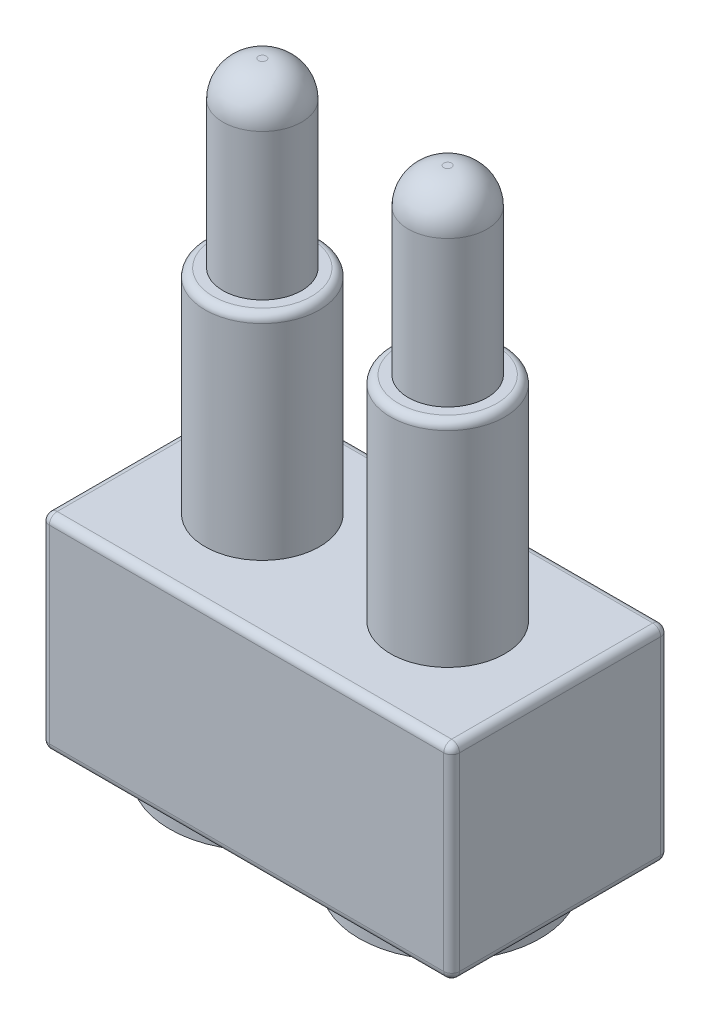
ISO-10303-21;
HEADER;
FILE_DESCRIPTION(('STEP AP214'),'2;1');
FILE_NAME('part.step','',(''),(''),'','','');
FILE_SCHEMA(('AUTOMOTIVE_DESIGN { 1 0 10303 214 1 1 1 1 }'));
ENDSEC;
DATA;
#1=APPLICATION_CONTEXT('core data for automotive mechanical design processes');
#2=APPLICATION_PROTOCOL_DEFINITION('international standard','automotive_design',2000,#1);
#3=PRODUCT_CONTEXT('',#1,'mechanical');
#4=PRODUCT('Part','Part','',(#3));
#5=PRODUCT_RELATED_PRODUCT_CATEGORY('part','',(#4));
#6=PRODUCT_DEFINITION_FORMATION('','',#4);
#7=PRODUCT_DEFINITION_CONTEXT('part definition',#1,'design');
#8=PRODUCT_DEFINITION('design','',#6,#7);
#9=PRODUCT_DEFINITION_SHAPE('','',#8);
#10=(LENGTH_UNIT() NAMED_UNIT(*) SI_UNIT(.MILLI.,.METRE.));
#11=(NAMED_UNIT(*) PLANE_ANGLE_UNIT() SI_UNIT($,.RADIAN.));
#12=(NAMED_UNIT(*) SI_UNIT($,.STERADIAN.) SOLID_ANGLE_UNIT());
#13=UNCERTAINTY_MEASURE_WITH_UNIT(LENGTH_MEASURE(1.E-05),#10,'distance_accuracy_value','');
#14=(GEOMETRIC_REPRESENTATION_CONTEXT(3) GLOBAL_UNCERTAINTY_ASSIGNED_CONTEXT((#13)) GLOBAL_UNIT_ASSIGNED_CONTEXT((#10,
#11,#12)) REPRESENTATION_CONTEXT('',''));
#15=CARTESIAN_POINT('',(0.,0.,0.));
#16=DIRECTION('',(0.,0.,1.));
#17=DIRECTION('',(1.,0.,0.));
#18=AXIS2_PLACEMENT_3D('',#15,#16,#17);
#19=CARTESIAN_POINT('',(2.6,2.6,-1.375));
#20=DIRECTION('',(-1.,0.,0.));
#21=DIRECTION('',(0.,0.,1.));
#22=AXIS2_PLACEMENT_3D('',#19,#20,#21);
#23=PLANE('',#22);
#24=DIRECTION('',(0.,0.,-1.));
#25=VECTOR('',#24,1.);
#26=CARTESIAN_POINT('',(2.6,2.5,1.375));
#27=LINE('',#26,#25);
#28=CARTESIAN_POINT('',(2.6,2.5,-1.275));
#29=VERTEX_POINT('',#28);
#30=CARTESIAN_POINT('',(2.6,2.5,1.275));
#31=VERTEX_POINT('',#30);
#32=EDGE_CURVE('E145',#29,#31,#27,.F.);
#33=ORIENTED_EDGE('',*,*,#32,.T.);
#34=DIRECTION('',(0.,-1.,0.));
#35=VECTOR('',#34,1.);
#36=CARTESIAN_POINT('',(2.6,2.6,1.275));
#37=LINE('',#36,#35);
#38=CARTESIAN_POINT('',(2.6,0.0999999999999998,1.275));
#39=VERTEX_POINT('',#38);
#40=EDGE_CURVE('E195',#31,#39,#37,.T.);
#41=ORIENTED_EDGE('',*,*,#40,.T.);
#42=DIRECTION('',(0.,0.,-1.));
#43=VECTOR('',#42,1.);
#44=CARTESIAN_POINT('',(2.6,0.0999999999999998,-1.375));
#45=LINE('',#44,#43);
#46=CARTESIAN_POINT('',(2.6,0.0999999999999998,-1.275));
#47=VERTEX_POINT('',#46);
#48=EDGE_CURVE('E192',#39,#47,#45,.T.);
#49=ORIENTED_EDGE('',*,*,#48,.T.);
#50=DIRECTION('',(0.,-1.,0.));
#51=VECTOR('',#50,1.);
#52=CARTESIAN_POINT('',(2.6,2.6,-1.275));
#53=LINE('',#52,#51);
#54=EDGE_CURVE('E190',#47,#29,#53,.F.);
#55=ORIENTED_EDGE('',*,*,#54,.T.);
#56=EDGE_LOOP('',(#33,#41,#49,#55));
#57=FACE_BOUND('',#56,.T.);
#58=ADVANCED_FACE('F37',(#57),#23,.F.);
#59=CARTESIAN_POINT('',(-2.6,2.6,-1.375));
#60=DIRECTION('',(0.,0.,1.));
#61=DIRECTION('',(1.,0.,0.));
#62=AXIS2_PLACEMENT_3D('',#59,#60,#61);
#63=PLANE('',#62);
#64=DIRECTION('',(-1.,0.,0.));
#65=VECTOR('',#64,1.);
#66=CARTESIAN_POINT('',(2.6,2.5,-1.375));
#67=LINE('',#66,#65);
#68=CARTESIAN_POINT('',(-2.5,2.5,-1.375));
#69=VERTEX_POINT('',#68);
#70=CARTESIAN_POINT('',(2.5,2.5,-1.375));
#71=VERTEX_POINT('',#70);
#72=EDGE_CURVE('E46',#69,#71,#67,.F.);
#73=ORIENTED_EDGE('',*,*,#72,.T.);
#74=DIRECTION('',(0.,-1.,0.));
#75=VECTOR('',#74,1.);
#76=CARTESIAN_POINT('',(2.5,2.6,-1.375));
#77=LINE('',#76,#75);
#78=CARTESIAN_POINT('',(2.5,0.0999999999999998,-1.375));
#79=VERTEX_POINT('',#78);
#80=EDGE_CURVE('E11',#71,#79,#77,.T.);
#81=ORIENTED_EDGE('',*,*,#80,.T.);
#82=DIRECTION('',(-1.,0.,0.));
#83=VECTOR('',#82,1.);
#84=CARTESIAN_POINT('',(-2.6,0.0999999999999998,-1.375));
#85=LINE('',#84,#83);
#86=CARTESIAN_POINT('',(-2.5,0.0999999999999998,-1.375));
#87=VERTEX_POINT('',#86);
#88=EDGE_CURVE('E206',#79,#87,#85,.T.);
#89=ORIENTED_EDGE('',*,*,#88,.T.);
#90=DIRECTION('',(0.,-1.,0.));
#91=VECTOR('',#90,1.);
#92=CARTESIAN_POINT('',(-2.5,2.6,-1.375));
#93=LINE('',#92,#91);
#94=EDGE_CURVE('E57',#87,#69,#93,.F.);
#95=ORIENTED_EDGE('',*,*,#94,.T.);
#96=EDGE_LOOP('',(#73,#81,#89,#95));
#97=FACE_BOUND('',#96,.T.);
#98=ADVANCED_FACE('F332',(#97),#63,.F.);
#99=CARTESIAN_POINT('',(-2.6,2.6,-1.375));
#100=DIRECTION('',(1.,0.,0.));
#101=DIRECTION('',(0.,0.,-1.));
#102=AXIS2_PLACEMENT_3D('',#99,#100,#101);
#103=PLANE('',#102);
#104=DIRECTION('',(0.,0.,1.));
#105=VECTOR('',#104,1.);
#106=CARTESIAN_POINT('',(-2.6,0.0999999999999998,-1.375));
#107=LINE('',#106,#105);
#108=CARTESIAN_POINT('',(-2.6,0.0999999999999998,-1.275));
#109=VERTEX_POINT('',#108);
#110=CARTESIAN_POINT('',(-2.6,0.0999999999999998,1.275));
#111=VERTEX_POINT('',#110);
#112=EDGE_CURVE('E174',#109,#111,#107,.T.);
#113=ORIENTED_EDGE('',*,*,#112,.T.);
#114=DIRECTION('',(0.,-1.,0.));
#115=VECTOR('',#114,1.);
#116=CARTESIAN_POINT('',(-2.6,2.6,1.275));
#117=LINE('',#116,#115);
#118=CARTESIAN_POINT('',(-2.6,2.5,1.275));
#119=VERTEX_POINT('',#118);
#120=EDGE_CURVE('E179',#111,#119,#117,.F.);
#121=ORIENTED_EDGE('',*,*,#120,.T.);
#122=DIRECTION('',(0.,0.,1.));
#123=VECTOR('',#122,1.);
#124=CARTESIAN_POINT('',(-2.6,2.5,-1.375));
#125=LINE('',#124,#123);
#126=CARTESIAN_POINT('',(-2.6,2.5,-1.275));
#127=VERTEX_POINT('',#126);
#128=EDGE_CURVE('E176',#119,#127,#125,.F.);
#129=ORIENTED_EDGE('',*,*,#128,.T.);
#130=DIRECTION('',(0.,-1.,0.));
#131=VECTOR('',#130,1.);
#132=CARTESIAN_POINT('',(-2.6,2.6,-1.275));
#133=LINE('',#132,#131);
#134=EDGE_CURVE('E172',#127,#109,#133,.T.);
#135=ORIENTED_EDGE('',*,*,#134,.T.);
#136=EDGE_LOOP('',(#113,#121,#129,#135));
#137=FACE_BOUND('',#136,.T.);
#138=ADVANCED_FACE('F338',(#137),#103,.F.);
#139=CARTESIAN_POINT('',(-2.6,2.6,1.375));
#140=DIRECTION('',(0.,0.,-1.));
#141=DIRECTION('',(-1.,0.,0.));
#142=AXIS2_PLACEMENT_3D('',#139,#140,#141);
#143=PLANE('',#142);
#144=DIRECTION('',(1.,0.,0.));
#145=VECTOR('',#144,1.);
#146=CARTESIAN_POINT('',(-2.6,2.5,1.375));
#147=LINE('',#146,#145);
#148=CARTESIAN_POINT('',(2.5,2.5,1.375));
#149=VERTEX_POINT('',#148);
#150=CARTESIAN_POINT('',(-2.5,2.5,1.375));
#151=VERTEX_POINT('',#150);
#152=EDGE_CURVE('E201',#149,#151,#147,.F.);
#153=ORIENTED_EDGE('',*,*,#152,.T.);
#154=DIRECTION('',(0.,-1.,0.));
#155=VECTOR('',#154,1.);
#156=CARTESIAN_POINT('',(-2.5,2.6,1.375));
#157=LINE('',#156,#155);
#158=CARTESIAN_POINT('',(-2.5,0.0999999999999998,1.375));
#159=VERTEX_POINT('',#158);
#160=EDGE_CURVE('E203',#151,#159,#157,.T.);
#161=ORIENTED_EDGE('',*,*,#160,.T.);
#162=DIRECTION('',(1.,0.,0.));
#163=VECTOR('',#162,1.);
#164=CARTESIAN_POINT('',(-2.6,0.0999999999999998,1.375));
#165=LINE('',#164,#163);
#166=CARTESIAN_POINT('',(2.5,0.0999999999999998,1.375));
#167=VERTEX_POINT('',#166);
#168=EDGE_CURVE('E197',#159,#167,#165,.T.);
#169=ORIENTED_EDGE('',*,*,#168,.T.);
#170=DIRECTION('',(0.,-1.,0.));
#171=VECTOR('',#170,1.);
#172=CARTESIAN_POINT('',(2.5,2.6,1.375));
#173=LINE('',#172,#171);
#174=EDGE_CURVE('E199',#167,#149,#173,.F.);
#175=ORIENTED_EDGE('',*,*,#174,.T.);
#176=EDGE_LOOP('',(#153,#161,#169,#175));
#177=FACE_BOUND('',#176,.T.);
#178=ADVANCED_FACE('F405',(#177),#143,.F.);
#179=CARTESIAN_POINT('',(0.,2.6,0.));
#180=DIRECTION('',(0.,1.,0.));
#181=DIRECTION('',(0.,0.,1.));
#182=AXIS2_PLACEMENT_3D('',#179,#180,#181);
#183=PLANE('',#182);
#184=DIRECTION('',(0.,0.,1.));
#185=VECTOR('',#184,1.);
#186=CARTESIAN_POINT('',(-2.5,2.6,1.375));
#187=LINE('',#186,#185);
#188=CARTESIAN_POINT('',(-2.5,2.6,-1.275));
#189=VERTEX_POINT('',#188);
#190=CARTESIAN_POINT('',(-2.5,2.6,1.275));
#191=VERTEX_POINT('',#190);
#192=EDGE_CURVE('E137',#189,#191,#187,.T.);
#193=ORIENTED_EDGE('',*,*,#192,.T.);
#194=DIRECTION('',(1.,0.,0.));
#195=VECTOR('',#194,1.);
#196=CARTESIAN_POINT('',(2.6,2.6,1.275));
#197=LINE('',#196,#195);
#198=CARTESIAN_POINT('',(2.5,2.6,1.275));
#199=VERTEX_POINT('',#198);
#200=EDGE_CURVE('E133',#191,#199,#197,.T.);
#201=ORIENTED_EDGE('',*,*,#200,.T.);
#202=DIRECTION('',(0.,0.,-1.));
#203=VECTOR('',#202,1.);
#204=CARTESIAN_POINT('',(2.5,2.6,-1.375));
#205=LINE('',#204,#203);
#206=CARTESIAN_POINT('',(2.5,2.6,-1.275));
#207=VERTEX_POINT('',#206);
#208=EDGE_CURVE('E124',#199,#207,#205,.T.);
#209=ORIENTED_EDGE('',*,*,#208,.T.);
#210=DIRECTION('',(-1.,0.,0.));
#211=VECTOR('',#210,1.);
#212=CARTESIAN_POINT('',(-2.6,2.6,-1.275));
#213=LINE('',#212,#211);
#214=EDGE_CURVE('E130',#207,#189,#213,.T.);
#215=ORIENTED_EDGE('',*,*,#214,.T.);
#216=EDGE_LOOP('',(#193,#201,#209,#215));
#217=FACE_BOUND('',#216,.T.);
#218=CARTESIAN_POINT('',(1.175,2.6,0.));
#219=DIRECTION('',(0.,1.,0.));
#220=DIRECTION('',(0.,0.,-1.));
#221=AXIS2_PLACEMENT_3D('',#218,#219,#220);
#222=CIRCLE('',#221,0.725);
#223=CARTESIAN_POINT('',(1.175,2.6,-0.725000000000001));
#224=VERTEX_POINT('',#223);
#225=EDGE_CURVE('E263',#224,#224,#222,.T.);
#226=ORIENTED_EDGE('',*,*,#225,.F.);
#227=EDGE_LOOP('',(#226));
#228=FACE_BOUND('',#227,.T.);
#229=CARTESIAN_POINT('',(-1.175,2.6,0.));
#230=DIRECTION('',(0.,1.,0.));
#231=DIRECTION('',(0.,0.,1.));
#232=AXIS2_PLACEMENT_3D('',#229,#230,#231);
#233=CIRCLE('',#232,0.725);
#234=CARTESIAN_POINT('',(-1.175,2.6,-0.725));
#235=VERTEX_POINT('',#234);
#236=EDGE_CURVE('E269',#235,#235,#233,.T.);
#237=ORIENTED_EDGE('',*,*,#236,.F.);
#238=EDGE_LOOP('',(#237));
#239=FACE_BOUND('',#238,.T.);
#240=ADVANCED_FACE('F127',(#217,#228,#239),#183,.T.);
#241=CARTESIAN_POINT('',(0.,0.,0.));
#242=DIRECTION('',(0.,1.,0.));
#243=DIRECTION('',(0.,0.,1.));
#244=AXIS2_PLACEMENT_3D('',#241,#242,#243);
#245=PLANE('',#244);
#246=DIRECTION('',(0.,0.,-1.));
#247=VECTOR('',#246,1.);
#248=CARTESIAN_POINT('',(2.5,0.,0.));
#249=LINE('',#248,#247);
#250=CARTESIAN_POINT('',(2.5,0.,-1.275));
#251=VERTEX_POINT('',#250);
#252=CARTESIAN_POINT('',(2.5,0.,1.275));
#253=VERTEX_POINT('',#252);
#254=EDGE_CURVE('E183',#251,#253,#249,.F.);
#255=ORIENTED_EDGE('',*,*,#254,.T.);
#256=DIRECTION('',(1.,0.,0.));
#257=VECTOR('',#256,1.);
#258=CARTESIAN_POINT('',(0.,0.,1.275));
#259=LINE('',#258,#257);
#260=CARTESIAN_POINT('',(-2.5,0.,1.275));
#261=VERTEX_POINT('',#260);
#262=EDGE_CURVE('E188',#253,#261,#259,.F.);
#263=ORIENTED_EDGE('',*,*,#262,.T.);
#264=DIRECTION('',(0.,0.,1.));
#265=VECTOR('',#264,1.);
#266=CARTESIAN_POINT('',(-2.5,0.,0.));
#267=LINE('',#266,#265);
#268=CARTESIAN_POINT('',(-2.5,0.,-1.275));
#269=VERTEX_POINT('',#268);
#270=EDGE_CURVE('E185',#261,#269,#267,.F.);
#271=ORIENTED_EDGE('',*,*,#270,.T.);
#272=DIRECTION('',(-1.,0.,0.));
#273=VECTOR('',#272,1.);
#274=CARTESIAN_POINT('',(0.,0.,-1.275));
#275=LINE('',#274,#273);
#276=EDGE_CURVE('E181',#269,#251,#275,.F.);
#277=ORIENTED_EDGE('',*,*,#276,.T.);
#278=EDGE_LOOP('',(#255,#263,#271,#277));
#279=FACE_BOUND('',#278,.T.);
#280=CARTESIAN_POINT('',(1.2,0.,0.));
#281=DIRECTION('',(0.,1.,0.));
#282=DIRECTION('',(0.,0.,1.));
#283=AXIS2_PLACEMENT_3D('',#280,#281,#282);
#284=CIRCLE('',#283,1.15);
#285=CARTESIAN_POINT('',(1.2,0.,1.15));
#286=VERTEX_POINT('',#285);
#287=EDGE_CURVE('E288',#286,#286,#284,.F.);
#288=ORIENTED_EDGE('',*,*,#287,.F.);
#289=EDGE_LOOP('',(#288));
#290=FACE_BOUND('',#289,.T.);
#291=CARTESIAN_POINT('',(-1.2,0.,0.));
#292=DIRECTION('',(0.,1.,0.));
#293=DIRECTION('',(0.,0.,1.));
#294=AXIS2_PLACEMENT_3D('',#291,#292,#293);
#295=CIRCLE('',#294,1.15);
#296=CARTESIAN_POINT('',(-1.2,0.,1.15));
#297=VERTEX_POINT('',#296);
#298=EDGE_CURVE('E285',#297,#297,#295,.F.);
#299=ORIENTED_EDGE('',*,*,#298,.F.);
#300=EDGE_LOOP('',(#299));
#301=FACE_BOUND('',#300,.T.);
#302=ADVANCED_FACE('F401',(#279,#290,#301),#245,.F.);
#303=CARTESIAN_POINT('',(-1.2,-0.3,0.));
#304=DIRECTION('',(0.,1.,0.));
#305=DIRECTION('',(0.,0.,1.));
#306=AXIS2_PLACEMENT_3D('',#303,#304,#305);
#307=CYLINDRICAL_SURFACE('',#306,1.15);
#308=CARTESIAN_POINT('',(-1.2,-0.3,0.));
#309=DIRECTION('',(0.,-1.,0.));
#310=DIRECTION('',(0.,0.,-1.));
#311=AXIS2_PLACEMENT_3D('',#308,#309,#310);
#312=CIRCLE('',#311,1.15);
#313=CARTESIAN_POINT('',(-1.2,-0.3,-1.15));
#314=VERTEX_POINT('',#313);
#315=EDGE_CURVE('E282',#314,#314,#312,.T.);
#316=ORIENTED_EDGE('',*,*,#315,.F.);
#317=EDGE_LOOP('',(#316));
#318=FACE_BOUND('',#317,.T.);
#319=ORIENTED_EDGE('',*,*,#298,.T.);
#320=EDGE_LOOP('',(#319));
#321=FACE_BOUND('',#320,.T.);
#322=ADVANCED_FACE('F397',(#318,#321),#307,.T.);
#323=CARTESIAN_POINT('',(-1.2,-0.3,0.));
#324=DIRECTION('',(0.,-1.,0.));
#325=DIRECTION('',(0.,0.,-1.));
#326=AXIS2_PLACEMENT_3D('',#323,#324,#325);
#327=PLANE('',#326);
#328=ORIENTED_EDGE('',*,*,#315,.T.);
#329=EDGE_LOOP('',(#328));
#330=FACE_BOUND('',#329,.T.);
#331=ADVANCED_FACE('F393',(#330),#327,.T.);
#332=CARTESIAN_POINT('',(1.2,-0.3,0.));
#333=DIRECTION('',(0.,1.,0.));
#334=DIRECTION('',(0.,0.,1.));
#335=AXIS2_PLACEMENT_3D('',#332,#333,#334);
#336=CYLINDRICAL_SURFACE('',#335,1.15);
#337=CARTESIAN_POINT('',(1.2,-0.3,0.));
#338=DIRECTION('',(0.,-1.,0.));
#339=DIRECTION('',(0.,0.,1.));
#340=AXIS2_PLACEMENT_3D('',#337,#338,#339);
#341=CIRCLE('',#340,1.15);
#342=CARTESIAN_POINT('',(1.2,-0.3,1.15));
#343=VERTEX_POINT('',#342);
#344=EDGE_CURVE('E274',#343,#343,#341,.T.);
#345=ORIENTED_EDGE('',*,*,#344,.F.);
#346=EDGE_LOOP('',(#345));
#347=FACE_BOUND('',#346,.T.);
#348=ORIENTED_EDGE('',*,*,#287,.T.);
#349=EDGE_LOOP('',(#348));
#350=FACE_BOUND('',#349,.T.);
#351=ADVANCED_FACE('F389',(#347,#350),#336,.T.);
#352=CARTESIAN_POINT('',(1.2,-0.3,0.));
#353=DIRECTION('',(0.,1.,0.));
#354=DIRECTION('',(0.,0.,1.));
#355=AXIS2_PLACEMENT_3D('',#352,#353,#354);
#356=PLANE('',#355);
#357=ORIENTED_EDGE('',*,*,#344,.T.);
#358=EDGE_LOOP('',(#357));
#359=FACE_BOUND('',#358,.T.);
#360=ADVANCED_FACE('F385',(#359),#356,.F.);
#361=CARTESIAN_POINT('',(-1.175,5.3,0.));
#362=DIRECTION('',(0.,-1.,0.));
#363=DIRECTION('',(0.,0.,-1.));
#364=AXIS2_PLACEMENT_3D('',#361,#362,#363);
#365=CYLINDRICAL_SURFACE('',#364,0.725);
#366=CARTESIAN_POINT('',(-1.175,5.2,0.));
#367=DIRECTION('',(0.,1.,0.));
#368=DIRECTION('',(0.,0.,1.));
#369=AXIS2_PLACEMENT_3D('',#366,#367,#368);
#370=CIRCLE('',#369,0.725);
#371=CARTESIAN_POINT('',(-1.175,5.2,-0.725));
#372=VERTEX_POINT('',#371);
#373=EDGE_CURVE('E307',#372,#372,#370,.F.);
#374=CARTESIAN_POINT('',(-1.175,5.2,-0.725));
#375=CARTESIAN_POINT('',(-1.175,5.17291666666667,-0.725));
#376=CARTESIAN_POINT('',(-1.175,5.14583333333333,-0.725));
#377=CARTESIAN_POINT('',(-1.175,5.09166666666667,-0.725));
#378=CARTESIAN_POINT('',(-1.175,5.06458333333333,-0.725));
#379=CARTESIAN_POINT('',(-1.175,5.01041666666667,-0.725));
#380=CARTESIAN_POINT('',(-1.175,4.98333333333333,-0.725));
#381=CARTESIAN_POINT('',(-1.175,4.92916666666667,-0.725));
#382=CARTESIAN_POINT('',(-1.175,4.90208333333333,-0.725));
#383=CARTESIAN_POINT('',(-1.175,4.84791666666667,-0.725));
#384=CARTESIAN_POINT('',(-1.175,4.82083333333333,-0.725));
#385=CARTESIAN_POINT('',(-1.175,4.76666666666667,-0.725));
#386=CARTESIAN_POINT('',(-1.175,4.73958333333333,-0.725));
#387=CARTESIAN_POINT('',(-1.175,4.68541666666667,-0.725));
#388=CARTESIAN_POINT('',(-1.175,4.65833333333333,-0.725));
#389=CARTESIAN_POINT('',(-1.175,4.60416666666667,-0.725));
#390=CARTESIAN_POINT('',(-1.175,4.57708333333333,-0.725));
#391=CARTESIAN_POINT('',(-1.175,4.52291666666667,-0.725));
#392=CARTESIAN_POINT('',(-1.175,4.49583333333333,-0.725));
#393=CARTESIAN_POINT('',(-1.175,4.44166666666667,-0.725));
#394=CARTESIAN_POINT('',(-1.175,4.41458333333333,-0.725));
#395=CARTESIAN_POINT('',(-1.175,4.36041666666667,-0.725));
#396=CARTESIAN_POINT('',(-1.175,4.33333333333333,-0.725));
#397=CARTESIAN_POINT('',(-1.175,4.27916666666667,-0.725));
#398=CARTESIAN_POINT('',(-1.175,4.25208333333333,-0.725));
#399=CARTESIAN_POINT('',(-1.175,4.19791666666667,-0.725));
#400=CARTESIAN_POINT('',(-1.175,4.17083333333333,-0.725));
#401=CARTESIAN_POINT('',(-1.175,4.11666666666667,-0.725));
#402=CARTESIAN_POINT('',(-1.175,4.08958333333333,-0.725));
#403=CARTESIAN_POINT('',(-1.175,4.03541666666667,-0.725));
#404=CARTESIAN_POINT('',(-1.175,4.00833333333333,-0.725));
#405=CARTESIAN_POINT('',(-1.175,3.95416666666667,-0.725));
#406=CARTESIAN_POINT('',(-1.175,3.92708333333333,-0.725));
#407=CARTESIAN_POINT('',(-1.175,3.87291666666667,-0.725));
#408=CARTESIAN_POINT('',(-1.175,3.84583333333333,-0.725));
#409=CARTESIAN_POINT('',(-1.175,3.79166666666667,-0.725));
#410=CARTESIAN_POINT('',(-1.175,3.76458333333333,-0.725));
#411=CARTESIAN_POINT('',(-1.175,3.71041666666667,-0.725));
#412=CARTESIAN_POINT('',(-1.175,3.68333333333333,-0.725));
#413=CARTESIAN_POINT('',(-1.175,3.62916666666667,-0.725));
#414=CARTESIAN_POINT('',(-1.175,3.60208333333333,-0.725));
#415=CARTESIAN_POINT('',(-1.175,3.54791666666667,-0.725));
#416=CARTESIAN_POINT('',(-1.175,3.52083333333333,-0.725));
#417=CARTESIAN_POINT('',(-1.175,3.46666666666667,-0.725));
#418=CARTESIAN_POINT('',(-1.175,3.43958333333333,-0.725));
#419=CARTESIAN_POINT('',(-1.175,3.38541666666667,-0.725));
#420=CARTESIAN_POINT('',(-1.175,3.35833333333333,-0.725));
#421=CARTESIAN_POINT('',(-1.175,3.30416666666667,-0.725));
#422=CARTESIAN_POINT('',(-1.175,3.27708333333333,-0.725));
#423=CARTESIAN_POINT('',(-1.175,3.22291666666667,-0.725));
#424=CARTESIAN_POINT('',(-1.175,3.19583333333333,-0.725));
#425=CARTESIAN_POINT('',(-1.175,3.14166666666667,-0.725));
#426=CARTESIAN_POINT('',(-1.175,3.11458333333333,-0.725));
#427=CARTESIAN_POINT('',(-1.175,3.06041666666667,-0.725));
#428=CARTESIAN_POINT('',(-1.175,3.03333333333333,-0.725));
#429=CARTESIAN_POINT('',(-1.175,2.97916666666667,-0.725));
#430=CARTESIAN_POINT('',(-1.175,2.95208333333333,-0.725));
#431=CARTESIAN_POINT('',(-1.175,2.89791666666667,-0.725));
#432=CARTESIAN_POINT('',(-1.175,2.87083333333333,-0.725));
#433=CARTESIAN_POINT('',(-1.175,2.81666666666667,-0.725));
#434=CARTESIAN_POINT('',(-1.175,2.78958333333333,-0.725));
#435=CARTESIAN_POINT('',(-1.175,2.73541666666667,-0.725));
#436=CARTESIAN_POINT('',(-1.175,2.70833333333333,-0.725));
#437=CARTESIAN_POINT('',(-1.175,2.65416666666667,-0.725));
#438=CARTESIAN_POINT('',(-1.175,2.62708333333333,-0.725));
#439=CARTESIAN_POINT('',(-1.175,2.6,-0.725));
#440=B_SPLINE_CURVE_WITH_KNOTS('',3,(#374,#375,#376,#377,#378,#379,#380,#381,#382,#383,#384,
#385,#386,#387,#388,#389,#390,#391,#392,#393,#394,#395,#396,#397,#398,#399,#400,#401,#402,#403,
#404,#405,#406,#407,#408,#409,#410,#411,#412,#413,#414,#415,#416,#417,#418,#419,#420,#421,#422,
#423,#424,#425,#426,#427,#428,#429,#430,#431,#432,#433,#434,#435,#436,#437,#438,#439),
.UNSPECIFIED.,.F.,.F.,(4,2,2,2,2,2,2,2,2,2,2,2,2,2,2,2,2,2,2,2,2,2,2,2,2,2,2,2,2,2,2,2,4),(0.,
0.0812499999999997,0.162499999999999,0.243749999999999,0.325,0.40625,0.487499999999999,0.56875,
0.65,0.731249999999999,0.8125,0.89375,0.974999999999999,1.05625,1.1375,1.21875,1.3,1.38125,
1.4625,1.54375,1.625,1.70625,1.7875,1.86875,1.95,2.03125,2.1125,2.19375,2.275,2.35625,2.4375,
2.51875,2.6),.UNSPECIFIED.);
#441=EDGE_CURVE('BSEAM381',#372,#235,#440,.T.);
#442=ORIENTED_EDGE('',*,*,#373,.T.);
#443=ORIENTED_EDGE('',*,*,#236,.T.);
#444=ORIENTED_EDGE('',*,*,#441,.T.);
#445=ORIENTED_EDGE('',*,*,#441,.F.);
#446=EDGE_LOOP('',(#442,#444,#443,#445));
#447=FACE_BOUND('',#446,.T.);
#448=ADVANCED_FACE('F381',(#447),#365,.T.);
#449=CARTESIAN_POINT('',(-1.175,5.3,0.));
#450=DIRECTION('',(0.,1.,0.));
#451=DIRECTION('',(0.,0.,1.));
#452=AXIS2_PLACEMENT_3D('',#449,#450,#451);
#453=PLANE('',#452);
#454=CARTESIAN_POINT('',(-1.175,5.3,0.));
#455=DIRECTION('',(0.,1.,0.));
#456=DIRECTION('',(0.,0.,1.));
#457=AXIS2_PLACEMENT_3D('',#454,#455,#456);
#458=CIRCLE('',#457,0.625);
#459=CARTESIAN_POINT('',(-1.175,5.3,0.625));
#460=VERTEX_POINT('',#459);
#461=EDGE_CURVE('E304',#460,#460,#458,.T.);
#462=ORIENTED_EDGE('',*,*,#461,.T.);
#463=EDGE_LOOP('',(#462));
#464=FACE_BOUND('',#463,.T.);
#465=CARTESIAN_POINT('',(-1.175,5.3,0.));
#466=DIRECTION('',(0.,1.,0.));
#467=DIRECTION('',(0.,0.,1.));
#468=AXIS2_PLACEMENT_3D('',#465,#466,#467);
#469=CIRCLE('',#468,0.5);
#470=CARTESIAN_POINT('',(-1.175,5.3,0.5));
#471=VERTEX_POINT('',#470);
#472=EDGE_CURVE('E277',#471,#471,#469,.T.);
#473=ORIENTED_EDGE('',*,*,#472,.F.);
#474=EDGE_LOOP('',(#473));
#475=FACE_BOUND('',#474,.T.);
#476=ADVANCED_FACE('F377',(#464,#475),#453,.T.);
#477=CARTESIAN_POINT('',(1.175,5.3,0.));
#478=DIRECTION('',(0.,-1.,0.));
#479=DIRECTION('',(0.,0.,-1.));
#480=AXIS2_PLACEMENT_3D('',#477,#478,#479);
#481=CYLINDRICAL_SURFACE('',#480,0.725);
#482=CARTESIAN_POINT('',(1.175,5.2,0.));
#483=DIRECTION('',(0.,-1.,0.));
#484=DIRECTION('',(0.,0.,-1.));
#485=AXIS2_PLACEMENT_3D('',#482,#483,#484);
#486=CIRCLE('',#485,0.725);
#487=CARTESIAN_POINT('',(1.175,5.2,-0.725000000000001));
#488=VERTEX_POINT('',#487);
#489=EDGE_CURVE('E163',#488,#488,#486,.T.);
#490=CARTESIAN_POINT('',(1.175,5.2,-0.725000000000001));
#491=CARTESIAN_POINT('',(1.175,5.17291666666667,-0.725000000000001));
#492=CARTESIAN_POINT('',(1.175,5.14583333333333,-0.725000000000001));
#493=CARTESIAN_POINT('',(1.175,5.09166666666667,-0.725000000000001));
#494=CARTESIAN_POINT('',(1.175,5.06458333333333,-0.725000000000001));
#495=CARTESIAN_POINT('',(1.175,5.01041666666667,-0.725000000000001));
#496=CARTESIAN_POINT('',(1.175,4.98333333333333,-0.725000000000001));
#497=CARTESIAN_POINT('',(1.175,4.92916666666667,-0.725000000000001));
#498=CARTESIAN_POINT('',(1.175,4.90208333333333,-0.725000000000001));
#499=CARTESIAN_POINT('',(1.175,4.84791666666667,-0.725000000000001));
#500=CARTESIAN_POINT('',(1.175,4.82083333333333,-0.725000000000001));
#501=CARTESIAN_POINT('',(1.175,4.76666666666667,-0.725000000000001));
#502=CARTESIAN_POINT('',(1.175,4.73958333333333,-0.725000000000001));
#503=CARTESIAN_POINT('',(1.175,4.68541666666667,-0.725000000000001));
#504=CARTESIAN_POINT('',(1.175,4.65833333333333,-0.725000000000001));
#505=CARTESIAN_POINT('',(1.175,4.60416666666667,-0.725000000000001));
#506=CARTESIAN_POINT('',(1.175,4.57708333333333,-0.725000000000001));
#507=CARTESIAN_POINT('',(1.175,4.52291666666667,-0.725000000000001));
#508=CARTESIAN_POINT('',(1.175,4.49583333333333,-0.725000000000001));
#509=CARTESIAN_POINT('',(1.175,4.44166666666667,-0.725000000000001));
#510=CARTESIAN_POINT('',(1.175,4.41458333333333,-0.725000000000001));
#511=CARTESIAN_POINT('',(1.175,4.36041666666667,-0.725000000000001));
#512=CARTESIAN_POINT('',(1.175,4.33333333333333,-0.725000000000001));
#513=CARTESIAN_POINT('',(1.175,4.27916666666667,-0.725000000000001));
#514=CARTESIAN_POINT('',(1.175,4.25208333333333,-0.725000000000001));
#515=CARTESIAN_POINT('',(1.175,4.19791666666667,-0.725000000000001));
#516=CARTESIAN_POINT('',(1.175,4.17083333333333,-0.725000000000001));
#517=CARTESIAN_POINT('',(1.175,4.11666666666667,-0.725000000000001));
#518=CARTESIAN_POINT('',(1.175,4.08958333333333,-0.725000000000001));
#519=CARTESIAN_POINT('',(1.175,4.03541666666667,-0.725000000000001));
#520=CARTESIAN_POINT('',(1.175,4.00833333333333,-0.725000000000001));
#521=CARTESIAN_POINT('',(1.175,3.95416666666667,-0.725000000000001));
#522=CARTESIAN_POINT('',(1.175,3.92708333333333,-0.725000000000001));
#523=CARTESIAN_POINT('',(1.175,3.87291666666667,-0.725000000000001));
#524=CARTESIAN_POINT('',(1.175,3.84583333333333,-0.725000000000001));
#525=CARTESIAN_POINT('',(1.175,3.79166666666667,-0.725000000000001));
#526=CARTESIAN_POINT('',(1.175,3.76458333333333,-0.725000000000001));
#527=CARTESIAN_POINT('',(1.175,3.71041666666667,-0.725000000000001));
#528=CARTESIAN_POINT('',(1.175,3.68333333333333,-0.725000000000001));
#529=CARTESIAN_POINT('',(1.175,3.62916666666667,-0.725000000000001));
#530=CARTESIAN_POINT('',(1.175,3.60208333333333,-0.725000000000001));
#531=CARTESIAN_POINT('',(1.175,3.54791666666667,-0.725000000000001));
#532=CARTESIAN_POINT('',(1.175,3.52083333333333,-0.725000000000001));
#533=CARTESIAN_POINT('',(1.175,3.46666666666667,-0.725000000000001));
#534=CARTESIAN_POINT('',(1.175,3.43958333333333,-0.725000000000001));
#535=CARTESIAN_POINT('',(1.175,3.38541666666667,-0.725000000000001));
#536=CARTESIAN_POINT('',(1.175,3.35833333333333,-0.725000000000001));
#537=CARTESIAN_POINT('',(1.175,3.30416666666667,-0.725000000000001));
#538=CARTESIAN_POINT('',(1.175,3.27708333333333,-0.725000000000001));
#539=CARTESIAN_POINT('',(1.175,3.22291666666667,-0.725000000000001));
#540=CARTESIAN_POINT('',(1.175,3.19583333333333,-0.725000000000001));
#541=CARTESIAN_POINT('',(1.175,3.14166666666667,-0.725000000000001));
#542=CARTESIAN_POINT('',(1.175,3.11458333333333,-0.725000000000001));
#543=CARTESIAN_POINT('',(1.175,3.06041666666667,-0.725000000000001));
#544=CARTESIAN_POINT('',(1.175,3.03333333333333,-0.725000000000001));
#545=CARTESIAN_POINT('',(1.175,2.97916666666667,-0.725000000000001));
#546=CARTESIAN_POINT('',(1.175,2.95208333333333,-0.725000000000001));
#547=CARTESIAN_POINT('',(1.175,2.89791666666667,-0.725000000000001));
#548=CARTESIAN_POINT('',(1.175,2.87083333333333,-0.725000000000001));
#549=CARTESIAN_POINT('',(1.175,2.81666666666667,-0.725000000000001));
#550=CARTESIAN_POINT('',(1.175,2.78958333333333,-0.725000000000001));
#551=CARTESIAN_POINT('',(1.175,2.73541666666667,-0.725000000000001));
#552=CARTESIAN_POINT('',(1.175,2.70833333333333,-0.725000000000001));
#553=CARTESIAN_POINT('',(1.175,2.65416666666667,-0.725000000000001));
#554=CARTESIAN_POINT('',(1.175,2.62708333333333,-0.725000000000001));
#555=CARTESIAN_POINT('',(1.175,2.6,-0.725000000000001));
#556=B_SPLINE_CURVE_WITH_KNOTS('',3,(#490,#491,#492,#493,#494,#495,#496,#497,#498,#499,#500,
#501,#502,#503,#504,#505,#506,#507,#508,#509,#510,#511,#512,#513,#514,#515,#516,#517,#518,#519,
#520,#521,#522,#523,#524,#525,#526,#527,#528,#529,#530,#531,#532,#533,#534,#535,#536,#537,#538,
#539,#540,#541,#542,#543,#544,#545,#546,#547,#548,#549,#550,#551,#552,#553,#554,#555),
.UNSPECIFIED.,.F.,.F.,(4,2,2,2,2,2,2,2,2,2,2,2,2,2,2,2,2,2,2,2,2,2,2,2,2,2,2,2,2,2,2,2,4),(0.,
0.0812500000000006,0.1625,0.24375,0.325000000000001,0.40625,0.487500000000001,0.568750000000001,
0.65,0.731250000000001,0.812500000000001,0.89375,0.975000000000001,1.05625,1.1375,1.21875,1.3,
1.38125,1.4625,1.54375,1.625,1.70625,1.7875,1.86875,1.95,2.03125,2.1125,2.19375,2.275,2.35625,
2.4375,2.51875,2.6),.UNSPECIFIED.);
#557=EDGE_CURVE('BSEAM374',#488,#224,#556,.T.);
#558=ORIENTED_EDGE('',*,*,#489,.T.);
#559=ORIENTED_EDGE('',*,*,#225,.T.);
#560=ORIENTED_EDGE('',*,*,#557,.T.);
#561=ORIENTED_EDGE('',*,*,#557,.F.);
#562=EDGE_LOOP('',(#558,#560,#559,#561));
#563=FACE_BOUND('',#562,.T.);
#564=ADVANCED_FACE('F374',(#563),#481,.T.);
#565=CARTESIAN_POINT('',(1.175,5.3,0.));
#566=DIRECTION('',(0.,-1.,0.));
#567=DIRECTION('',(0.,0.,-1.));
#568=AXIS2_PLACEMENT_3D('',#565,#566,#567);
#569=PLANE('',#568);
#570=CARTESIAN_POINT('',(1.175,5.3,0.));
#571=DIRECTION('',(0.,-1.,0.));
#572=DIRECTION('',(0.,0.,-1.));
#573=AXIS2_PLACEMENT_3D('',#570,#571,#572);
#574=CIRCLE('',#573,0.625);
#575=CARTESIAN_POINT('',(1.175,5.3,-0.625));
#576=VERTEX_POINT('',#575);
#577=EDGE_CURVE('E166',#576,#576,#574,.F.);
#578=ORIENTED_EDGE('',*,*,#577,.T.);
#579=EDGE_LOOP('',(#578));
#580=FACE_BOUND('',#579,.T.);
#581=CARTESIAN_POINT('',(1.175,5.3,0.));
#582=DIRECTION('',(0.,1.,0.));
#583=DIRECTION('',(0.,0.,1.));
#584=AXIS2_PLACEMENT_3D('',#581,#582,#583);
#585=CIRCLE('',#584,0.5);
#586=CARTESIAN_POINT('',(1.175,5.3,0.5));
#587=VERTEX_POINT('',#586);
#588=EDGE_CURVE('E295',#587,#587,#585,.T.);
#589=ORIENTED_EDGE('',*,*,#588,.F.);
#590=EDGE_LOOP('',(#589));
#591=FACE_BOUND('',#590,.T.);
#592=ADVANCED_FACE('F312',(#580,#591),#569,.F.);
#593=CARTESIAN_POINT('',(-1.175,7.6,0.));
#594=DIRECTION('',(0.,-1.,0.));
#595=DIRECTION('',(0.,0.,-1.));
#596=AXIS2_PLACEMENT_3D('',#593,#594,#595);
#597=CYLINDRICAL_SURFACE('',#596,0.5);
#598=CARTESIAN_POINT('',(-1.175,7.15,0.));
#599=DIRECTION('',(0.,1.,0.));
#600=DIRECTION('',(0.,0.,1.));
#601=AXIS2_PLACEMENT_3D('',#598,#599,#600);
#602=CIRCLE('',#601,0.5);
#603=CARTESIAN_POINT('',(-1.175,7.15,0.5));
#604=VERTEX_POINT('',#603);
#605=EDGE_CURVE('E294',#604,#604,#602,.F.);
#606=ORIENTED_EDGE('',*,*,#605,.T.);
#607=EDGE_LOOP('',(#606));
#608=FACE_BOUND('',#607,.T.);
#609=ORIENTED_EDGE('',*,*,#472,.T.);
#610=EDGE_LOOP('',(#609));
#611=FACE_BOUND('',#610,.T.);
#612=ADVANCED_FACE('F367',(#608,#611),#597,.T.);
#613=CARTESIAN_POINT('',(-1.175,7.6,0.));
#614=DIRECTION('',(0.,1.,0.));
#615=DIRECTION('',(0.,0.,1.));
#616=AXIS2_PLACEMENT_3D('',#613,#614,#615);
#617=PLANE('',#616);
#618=CARTESIAN_POINT('',(-1.175,7.6,0.));
#619=DIRECTION('',(0.,1.,0.));
#620=DIRECTION('',(0.,0.,1.));
#621=AXIS2_PLACEMENT_3D('',#618,#619,#620);
#622=CIRCLE('',#621,0.0500000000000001);
#623=CARTESIAN_POINT('',(-1.175,7.6,0.0500000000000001));
#624=VERTEX_POINT('',#623);
#625=EDGE_CURVE('E291',#624,#624,#622,.T.);
#626=ORIENTED_EDGE('',*,*,#625,.T.);
#627=EDGE_LOOP('',(#626));
#628=FACE_BOUND('',#627,.T.);
#629=ADVANCED_FACE('F361',(#628),#617,.T.);
#630=CARTESIAN_POINT('',(1.175,7.6,0.));
#631=DIRECTION('',(0.,-1.,0.));
#632=DIRECTION('',(0.,0.,-1.));
#633=AXIS2_PLACEMENT_3D('',#630,#631,#632);
#634=CYLINDRICAL_SURFACE('',#633,0.5);
#635=CARTESIAN_POINT('',(1.175,7.15,0.));
#636=DIRECTION('',(0.,1.,0.));
#637=DIRECTION('',(0.,0.,1.));
#638=AXIS2_PLACEMENT_3D('',#635,#636,#637);
#639=CIRCLE('',#638,0.5);
#640=CARTESIAN_POINT('',(1.175,7.15,0.5));
#641=VERTEX_POINT('',#640);
#642=EDGE_CURVE('E301',#641,#641,#639,.F.);
#643=ORIENTED_EDGE('',*,*,#642,.T.);
#644=EDGE_LOOP('',(#643));
#645=FACE_BOUND('',#644,.T.);
#646=ORIENTED_EDGE('',*,*,#588,.T.);
#647=EDGE_LOOP('',(#646));
#648=FACE_BOUND('',#647,.T.);
#649=ADVANCED_FACE('F356',(#645,#648),#634,.T.);
#650=CARTESIAN_POINT('',(1.175,7.6,0.));
#651=DIRECTION('',(0.,1.,0.));
#652=DIRECTION('',(0.,0.,1.));
#653=AXIS2_PLACEMENT_3D('',#650,#651,#652);
#654=PLANE('',#653);
#655=CARTESIAN_POINT('',(1.175,7.6,0.));
#656=DIRECTION('',(0.,1.,0.));
#657=DIRECTION('',(0.,0.,1.));
#658=AXIS2_PLACEMENT_3D('',#655,#656,#657);
#659=CIRCLE('',#658,0.0500000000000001);
#660=CARTESIAN_POINT('',(1.175,7.6,0.0499999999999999));
#661=VERTEX_POINT('',#660);
#662=EDGE_CURVE('E298',#661,#661,#659,.T.);
#663=ORIENTED_EDGE('',*,*,#662,.T.);
#664=EDGE_LOOP('',(#663));
#665=FACE_BOUND('',#664,.T.);
#666=ADVANCED_FACE('F345',(#665),#654,.T.);
#667=CARTESIAN_POINT('',(-1.175,7.15,0.));
#668=DIRECTION('',(0.,1.,0.));
#669=DIRECTION('',(0.,0.,1.));
#670=AXIS2_PLACEMENT_3D('',#667,#668,#669);
#671=DEGENERATE_TOROIDAL_SURFACE('',#670,0.0500000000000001,0.45,.T.);
#672=ORIENTED_EDGE('',*,*,#605,.F.);
#673=EDGE_LOOP('',(#672));
#674=FACE_BOUND('',#673,.T.);
#675=ORIENTED_EDGE('',*,*,#625,.F.);
#676=EDGE_LOOP('',(#675));
#677=FACE_BOUND('',#676,.T.);
#678=ADVANCED_FACE('F342',(#674,#677),#671,.T.);
#679=CARTESIAN_POINT('',(1.175,7.15,0.));
#680=DIRECTION('',(0.,1.,0.));
#681=DIRECTION('',(0.,0.,1.));
#682=AXIS2_PLACEMENT_3D('',#679,#680,#681);
#683=DEGENERATE_TOROIDAL_SURFACE('',#682,0.0500000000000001,0.45,.T.);
#684=ORIENTED_EDGE('',*,*,#642,.F.);
#685=EDGE_LOOP('',(#684));
#686=FACE_BOUND('',#685,.T.);
#687=ORIENTED_EDGE('',*,*,#662,.F.);
#688=EDGE_LOOP('',(#687));
#689=FACE_BOUND('',#688,.T.);
#690=ADVANCED_FACE('F326',(#686,#689),#683,.T.);
#691=CARTESIAN_POINT('',(-1.175,5.2,0.));
#692=DIRECTION('',(0.,1.,0.));
#693=DIRECTION('',(0.,0.,1.));
#694=AXIS2_PLACEMENT_3D('',#691,#692,#693);
#695=TOROIDAL_SURFACE('',#694,0.625,0.1);
#696=ORIENTED_EDGE('',*,*,#373,.F.);
#697=EDGE_LOOP('',(#696));
#698=FACE_BOUND('',#697,.T.);
#699=ORIENTED_EDGE('',*,*,#461,.F.);
#700=EDGE_LOOP('',(#699));
#701=FACE_BOUND('',#700,.T.);
#702=ADVANCED_FACE('F317',(#698,#701),#695,.T.);
#703=CARTESIAN_POINT('',(1.175,5.2,0.));
#704=DIRECTION('',(0.,-1.,0.));
#705=DIRECTION('',(0.,0.,-1.));
#706=AXIS2_PLACEMENT_3D('',#703,#704,#705);
#707=TOROIDAL_SURFACE('',#706,0.625,0.1);
#708=ORIENTED_EDGE('',*,*,#489,.F.);
#709=EDGE_LOOP('',(#708));
#710=FACE_BOUND('',#709,.T.);
#711=ORIENTED_EDGE('',*,*,#577,.F.);
#712=EDGE_LOOP('',(#711));
#713=FACE_BOUND('',#712,.T.);
#714=ADVANCED_FACE('F315',(#710,#713),#707,.T.);
#715=CARTESIAN_POINT('',(2.5,0.0999999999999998,-1.375));
#716=DIRECTION('',(0.,0.,-1.));
#717=DIRECTION('',(-1.,0.,0.));
#718=AXIS2_PLACEMENT_3D('',#715,#716,#717);
#719=CYLINDRICAL_SURFACE('',#718,0.1);
#720=CARTESIAN_POINT('',(2.5,0.0999999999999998,-1.275));
#721=DIRECTION('',(0.,0.,-1.));
#722=DIRECTION('',(-1.,0.,0.));
#723=AXIS2_PLACEMENT_3D('',#720,#721,#722);
#724=CIRCLE('',#723,0.1);
#725=EDGE_CURVE('E41',#47,#251,#724,.T.);
#726=ORIENTED_EDGE('',*,*,#725,.F.);
#727=ORIENTED_EDGE('',*,*,#48,.F.);
#728=CARTESIAN_POINT('',(2.5,0.1,1.275));
#729=DIRECTION('',(0.,0.,1.));
#730=DIRECTION('',(1.,0.,0.));
#731=AXIS2_PLACEMENT_3D('',#728,#729,#730);
#732=CIRCLE('',#731,0.1);
#733=EDGE_CURVE('E256',#253,#39,#732,.T.);
#734=ORIENTED_EDGE('',*,*,#733,.F.);
#735=ORIENTED_EDGE('',*,*,#254,.F.);
#736=EDGE_LOOP('',(#726,#727,#734,#735));
#737=FACE_BOUND('',#736,.T.);
#738=ADVANCED_FACE('F39',(#737),#719,.T.);
#739=CARTESIAN_POINT('',(2.5,0.1,-1.275));
#740=DIRECTION('',(0.,0.,1.));
#741=DIRECTION('',(1.,0.,0.));
#742=AXIS2_PLACEMENT_3D('',#739,#740,#741);
#743=SPHERICAL_SURFACE('',#742,0.1);
#744=CARTESIAN_POINT('',(2.5,0.0999999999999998,-1.275));
#745=DIRECTION('',(0.,-1.,0.));
#746=DIRECTION('',(0.,0.,-1.));
#747=AXIS2_PLACEMENT_3D('',#744,#745,#746);
#748=CIRCLE('',#747,0.1);
#749=EDGE_CURVE('E251',#47,#79,#748,.F.);
#750=ORIENTED_EDGE('',*,*,#749,.F.);
#751=ORIENTED_EDGE('',*,*,#725,.T.);
#752=CARTESIAN_POINT('',(2.5,0.1,-1.275));
#753=DIRECTION('',(1.,0.,0.));
#754=DIRECTION('',(0.,0.,-1.));
#755=AXIS2_PLACEMENT_3D('',#752,#753,#754);
#756=CIRCLE('',#755,0.1);
#757=EDGE_CURVE('E254',#79,#251,#756,.F.);
#758=ORIENTED_EDGE('',*,*,#757,.F.);
#759=EDGE_LOOP('',(#750,#751,#758));
#760=FACE_BOUND('',#759,.T.);
#761=ADVANCED_FACE('F324',(#760),#743,.T.);
#762=CARTESIAN_POINT('',(2.5,0.1,1.275));
#763=DIRECTION('',(0.,0.,1.));
#764=DIRECTION('',(1.,0.,0.));
#765=AXIS2_PLACEMENT_3D('',#762,#763,#764);
#766=SPHERICAL_SURFACE('',#765,0.1);
#767=CARTESIAN_POINT('',(2.5,0.0999999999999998,1.275));
#768=DIRECTION('',(1.,0.,0.));
#769=DIRECTION('',(0.,0.,-1.));
#770=AXIS2_PLACEMENT_3D('',#767,#768,#769);
#771=CIRCLE('',#770,0.1);
#772=EDGE_CURVE('E245',#253,#167,#771,.F.);
#773=ORIENTED_EDGE('',*,*,#772,.F.);
#774=ORIENTED_EDGE('',*,*,#733,.T.);
#775=CARTESIAN_POINT('',(2.5,0.0999999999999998,1.275));
#776=DIRECTION('',(0.,-1.,0.));
#777=DIRECTION('',(0.,0.,-1.));
#778=AXIS2_PLACEMENT_3D('',#775,#776,#777);
#779=CIRCLE('',#778,0.1);
#780=EDGE_CURVE('E248',#167,#39,#779,.F.);
#781=ORIENTED_EDGE('',*,*,#780,.F.);
#782=EDGE_LOOP('',(#773,#774,#781));
#783=FACE_BOUND('',#782,.T.);
#784=ADVANCED_FACE('F504',(#783),#766,.T.);
#785=CARTESIAN_POINT('',(-2.6,0.0999999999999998,-1.275));
#786=DIRECTION('',(-1.,0.,0.));
#787=DIRECTION('',(0.,0.,1.));
#788=AXIS2_PLACEMENT_3D('',#785,#786,#787);
#789=CYLINDRICAL_SURFACE('',#788,0.1);
#790=ORIENTED_EDGE('',*,*,#757,.T.);
#791=ORIENTED_EDGE('',*,*,#276,.F.);
#792=CARTESIAN_POINT('',(-2.5,0.0999999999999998,-1.275));
#793=DIRECTION('',(-1.,0.,0.));
#794=DIRECTION('',(0.,0.,1.));
#795=AXIS2_PLACEMENT_3D('',#792,#793,#794);
#796=CIRCLE('',#795,0.1);
#797=EDGE_CURVE('E240',#87,#269,#796,.T.);
#798=ORIENTED_EDGE('',*,*,#797,.F.);
#799=ORIENTED_EDGE('',*,*,#88,.F.);
#800=EDGE_LOOP('',(#790,#791,#798,#799));
#801=FACE_BOUND('',#800,.T.);
#802=ADVANCED_FACE('F459',(#801),#789,.T.);
#803=CARTESIAN_POINT('',(2.5,2.6,-1.275));
#804=DIRECTION('',(0.,-1.,0.));
#805=DIRECTION('',(0.,0.,-1.));
#806=AXIS2_PLACEMENT_3D('',#803,#804,#805);
#807=CYLINDRICAL_SURFACE('',#806,0.1);
#808=ORIENTED_EDGE('',*,*,#749,.T.);
#809=ORIENTED_EDGE('',*,*,#80,.F.);
#810=CARTESIAN_POINT('',(2.5,2.5,-1.275));
#811=DIRECTION('',(0.,1.,0.));
#812=DIRECTION('',(0.,0.,1.));
#813=AXIS2_PLACEMENT_3D('',#810,#811,#812);
#814=CIRCLE('',#813,0.1);
#815=EDGE_CURVE('E149',#29,#71,#814,.T.);
#816=ORIENTED_EDGE('',*,*,#815,.F.);
#817=ORIENTED_EDGE('',*,*,#54,.F.);
#818=EDGE_LOOP('',(#808,#809,#816,#817));
#819=FACE_BOUND('',#818,.T.);
#820=ADVANCED_FACE('F454',(#819),#807,.T.);
#821=CARTESIAN_POINT('',(2.5,2.5,0.));
#822=DIRECTION('',(0.,0.,1.));
#823=DIRECTION('',(1.,0.,0.));
#824=AXIS2_PLACEMENT_3D('',#821,#822,#823);
#825=CYLINDRICAL_SURFACE('',#824,0.1);
#826=CARTESIAN_POINT('',(2.5,2.5,1.275));
#827=DIRECTION('',(0.,0.,1.));
#828=DIRECTION('',(0.,-1.,0.));
#829=AXIS2_PLACEMENT_3D('',#826,#827,#828);
#830=CIRCLE('',#829,0.1);
#831=EDGE_CURVE('E150',#31,#199,#830,.T.);
#832=ORIENTED_EDGE('',*,*,#831,.F.);
#833=ORIENTED_EDGE('',*,*,#32,.F.);
#834=CARTESIAN_POINT('',(2.5,2.5,-1.275));
#835=DIRECTION('',(0.,0.,-1.));
#836=DIRECTION('',(-1.,0.,0.));
#837=AXIS2_PLACEMENT_3D('',#834,#835,#836);
#838=CIRCLE('',#837,0.1);
#839=EDGE_CURVE('E141',#207,#29,#838,.T.);
#840=ORIENTED_EDGE('',*,*,#839,.F.);
#841=ORIENTED_EDGE('',*,*,#208,.F.);
#842=EDGE_LOOP('',(#832,#833,#840,#841));
#843=FACE_BOUND('',#842,.T.);
#844=ADVANCED_FACE('F143',(#843),#825,.T.);
#845=CARTESIAN_POINT('',(2.5,2.6,1.275));
#846=DIRECTION('',(0.,-1.,0.));
#847=DIRECTION('',(0.,0.,-1.));
#848=AXIS2_PLACEMENT_3D('',#845,#846,#847);
#849=CYLINDRICAL_SURFACE('',#848,0.1);
#850=ORIENTED_EDGE('',*,*,#780,.T.);
#851=ORIENTED_EDGE('',*,*,#40,.F.);
#852=CARTESIAN_POINT('',(2.5,2.5,1.275));
#853=DIRECTION('',(0.,1.,0.));
#854=DIRECTION('',(0.,0.,1.));
#855=AXIS2_PLACEMENT_3D('',#852,#853,#854);
#856=CIRCLE('',#855,0.1);
#857=EDGE_CURVE('E236',#149,#31,#856,.T.);
#858=ORIENTED_EDGE('',*,*,#857,.F.);
#859=ORIENTED_EDGE('',*,*,#174,.F.);
#860=EDGE_LOOP('',(#850,#851,#858,#859));
#861=FACE_BOUND('',#860,.T.);
#862=ADVANCED_FACE('F449',(#861),#849,.T.);
#863=CARTESIAN_POINT('',(-2.6,0.0999999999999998,1.275));
#864=DIRECTION('',(1.,0.,0.));
#865=DIRECTION('',(0.,0.,-1.));
#866=AXIS2_PLACEMENT_3D('',#863,#864,#865);
#867=CYLINDRICAL_SURFACE('',#866,0.1);
#868=ORIENTED_EDGE('',*,*,#772,.T.);
#869=ORIENTED_EDGE('',*,*,#168,.F.);
#870=CARTESIAN_POINT('',(-2.5,0.1,1.275));
#871=DIRECTION('',(-1.,0.,0.));
#872=DIRECTION('',(0.,0.,1.));
#873=AXIS2_PLACEMENT_3D('',#870,#871,#872);
#874=CIRCLE('',#873,0.1);
#875=EDGE_CURVE('E233',#261,#159,#874,.T.);
#876=ORIENTED_EDGE('',*,*,#875,.F.);
#877=ORIENTED_EDGE('',*,*,#262,.F.);
#878=EDGE_LOOP('',(#868,#869,#876,#877));
#879=FACE_BOUND('',#878,.T.);
#880=ADVANCED_FACE('F492',(#879),#867,.T.);
#881=CARTESIAN_POINT('',(-2.5,0.0999999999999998,-1.375));
#882=DIRECTION('',(0.,0.,1.));
#883=DIRECTION('',(1.,0.,0.));
#884=AXIS2_PLACEMENT_3D('',#881,#882,#883);
#885=CYLINDRICAL_SURFACE('',#884,0.1);
#886=CARTESIAN_POINT('',(-2.5,0.1,-1.275));
#887=DIRECTION('',(0.,0.,-1.));
#888=DIRECTION('',(-1.,0.,0.));
#889=AXIS2_PLACEMENT_3D('',#886,#887,#888);
#890=CIRCLE('',#889,0.1);
#891=EDGE_CURVE('E242',#269,#109,#890,.T.);
#892=ORIENTED_EDGE('',*,*,#891,.F.);
#893=ORIENTED_EDGE('',*,*,#270,.F.);
#894=CARTESIAN_POINT('',(-2.5,0.0999999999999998,1.275));
#895=DIRECTION('',(0.,0.,1.));
#896=DIRECTION('',(1.,0.,0.));
#897=AXIS2_PLACEMENT_3D('',#894,#895,#896);
#898=CIRCLE('',#897,0.1);
#899=EDGE_CURVE('E230',#111,#261,#898,.T.);
#900=ORIENTED_EDGE('',*,*,#899,.F.);
#901=ORIENTED_EDGE('',*,*,#112,.F.);
#902=EDGE_LOOP('',(#892,#893,#900,#901));
#903=FACE_BOUND('',#902,.T.);
#904=ADVANCED_FACE('F424',(#903),#885,.T.);
#905=CARTESIAN_POINT('',(-2.5,0.1,-1.275));
#906=DIRECTION('',(0.,0.,1.));
#907=DIRECTION('',(1.,0.,0.));
#908=AXIS2_PLACEMENT_3D('',#905,#906,#907);
#909=SPHERICAL_SURFACE('',#908,0.1);
#910=ORIENTED_EDGE('',*,*,#797,.T.);
#911=ORIENTED_EDGE('',*,*,#891,.T.);
#912=CARTESIAN_POINT('',(-2.5,0.0999999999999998,-1.275));
#913=DIRECTION('',(0.,-1.,0.));
#914=DIRECTION('',(0.,0.,-1.));
#915=AXIS2_PLACEMENT_3D('',#912,#913,#914);
#916=CIRCLE('',#915,0.1);
#917=EDGE_CURVE('E156',#87,#109,#916,.F.);
#918=ORIENTED_EDGE('',*,*,#917,.F.);
#919=EDGE_LOOP('',(#910,#911,#918));
#920=FACE_BOUND('',#919,.T.);
#921=ADVANCED_FACE('F461',(#920),#909,.T.);
#922=CARTESIAN_POINT('',(2.5,2.5,-1.275));
#923=DIRECTION('',(0.,0.,1.));
#924=DIRECTION('',(1.,0.,0.));
#925=AXIS2_PLACEMENT_3D('',#922,#923,#924);
#926=SPHERICAL_SURFACE('',#925,0.1);
#927=ORIENTED_EDGE('',*,*,#839,.T.);
#928=ORIENTED_EDGE('',*,*,#815,.T.);
#929=CARTESIAN_POINT('',(2.5,2.5,-1.275));
#930=DIRECTION('',(1.,0.,0.));
#931=DIRECTION('',(0.,1.,0.));
#932=AXIS2_PLACEMENT_3D('',#929,#930,#931);
#933=CIRCLE('',#932,0.1);
#934=EDGE_CURVE('E153',#207,#71,#933,.F.);
#935=ORIENTED_EDGE('',*,*,#934,.F.);
#936=EDGE_LOOP('',(#927,#928,#935));
#937=FACE_BOUND('',#936,.T.);
#938=ADVANCED_FACE('F154',(#937),#926,.T.);
#939=CARTESIAN_POINT('',(2.5,2.5,1.275));
#940=DIRECTION('',(0.,0.,1.));
#941=DIRECTION('',(1.,0.,0.));
#942=AXIS2_PLACEMENT_3D('',#939,#940,#941);
#943=SPHERICAL_SURFACE('',#942,0.1);
#944=ORIENTED_EDGE('',*,*,#857,.T.);
#945=ORIENTED_EDGE('',*,*,#831,.T.);
#946=CARTESIAN_POINT('',(2.5,2.5,1.275));
#947=DIRECTION('',(1.,0.,0.));
#948=DIRECTION('',(0.,0.,-1.));
#949=AXIS2_PLACEMENT_3D('',#946,#947,#948);
#950=CIRCLE('',#949,0.1);
#951=EDGE_CURVE('E157',#149,#199,#950,.F.);
#952=ORIENTED_EDGE('',*,*,#951,.F.);
#953=EDGE_LOOP('',(#944,#945,#952));
#954=FACE_BOUND('',#953,.T.);
#955=ADVANCED_FACE('F445',(#954),#943,.T.);
#956=CARTESIAN_POINT('',(-2.5,0.1,1.275));
#957=DIRECTION('',(0.,0.,1.));
#958=DIRECTION('',(1.,0.,0.));
#959=AXIS2_PLACEMENT_3D('',#956,#957,#958);
#960=SPHERICAL_SURFACE('',#959,0.1);
#961=ORIENTED_EDGE('',*,*,#899,.T.);
#962=ORIENTED_EDGE('',*,*,#875,.T.);
#963=CARTESIAN_POINT('',(-2.5,0.0999999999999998,1.275));
#964=DIRECTION('',(0.,-1.,0.));
#965=DIRECTION('',(0.,0.,-1.));
#966=AXIS2_PLACEMENT_3D('',#963,#964,#965);
#967=CIRCLE('',#966,0.1);
#968=EDGE_CURVE('E224',#111,#159,#967,.F.);
#969=ORIENTED_EDGE('',*,*,#968,.F.);
#970=EDGE_LOOP('',(#961,#962,#969));
#971=FACE_BOUND('',#970,.T.);
#972=ADVANCED_FACE('F427',(#971),#960,.T.);
#973=CARTESIAN_POINT('',(-2.5,2.6,-1.275));
#974=DIRECTION('',(0.,-1.,0.));
#975=DIRECTION('',(0.,0.,-1.));
#976=AXIS2_PLACEMENT_3D('',#973,#974,#975);
#977=CYLINDRICAL_SURFACE('',#976,0.1);
#978=ORIENTED_EDGE('',*,*,#917,.T.);
#979=ORIENTED_EDGE('',*,*,#134,.F.);
#980=CARTESIAN_POINT('',(-2.5,2.5,-1.275));
#981=DIRECTION('',(0.,1.,0.));
#982=DIRECTION('',(0.,0.,1.));
#983=AXIS2_PLACEMENT_3D('',#980,#981,#982);
#984=CIRCLE('',#983,0.1);
#985=EDGE_CURVE('E221',#69,#127,#984,.T.);
#986=ORIENTED_EDGE('',*,*,#985,.F.);
#987=ORIENTED_EDGE('',*,*,#94,.F.);
#988=EDGE_LOOP('',(#978,#979,#986,#987));
#989=FACE_BOUND('',#988,.T.);
#990=ADVANCED_FACE('F464',(#989),#977,.T.);
#991=CARTESIAN_POINT('',(0.,2.5,-1.275));
#992=DIRECTION('',(1.,0.,0.));
#993=DIRECTION('',(0.,0.,-1.));
#994=AXIS2_PLACEMENT_3D('',#991,#992,#993);
#995=CYLINDRICAL_SURFACE('',#994,0.1);
#996=ORIENTED_EDGE('',*,*,#934,.T.);
#997=ORIENTED_EDGE('',*,*,#72,.F.);
#998=CARTESIAN_POINT('',(-2.5,2.5,-1.275));
#999=DIRECTION('',(-1.,0.,0.));
#1000=DIRECTION('',(0.,0.,1.));
#1001=AXIS2_PLACEMENT_3D('',#998,#999,#1000);
#1002=CIRCLE('',#1001,0.1);
#1003=EDGE_CURVE('E161',#189,#69,#1002,.T.);
#1004=ORIENTED_EDGE('',*,*,#1003,.F.);
#1005=ORIENTED_EDGE('',*,*,#214,.F.);
#1006=EDGE_LOOP('',(#996,#997,#1004,#1005));
#1007=FACE_BOUND('',#1006,.T.);
#1008=ADVANCED_FACE('F159',(#1007),#995,.T.);
#1009=CARTESIAN_POINT('',(0.,2.5,1.275));
#1010=DIRECTION('',(-1.,0.,0.));
#1011=DIRECTION('',(0.,0.,1.));
#1012=AXIS2_PLACEMENT_3D('',#1009,#1010,#1011);
#1013=CYLINDRICAL_SURFACE('',#1012,0.1);
#1014=ORIENTED_EDGE('',*,*,#951,.T.);
#1015=ORIENTED_EDGE('',*,*,#200,.F.);
#1016=CARTESIAN_POINT('',(-2.5,2.5,1.275));
#1017=DIRECTION('',(-1.,0.,0.));
#1018=DIRECTION('',(0.,0.,1.));
#1019=AXIS2_PLACEMENT_3D('',#1016,#1017,#1018);
#1020=CIRCLE('',#1019,0.1);
#1021=EDGE_CURVE('E217',#151,#191,#1020,.T.);
#1022=ORIENTED_EDGE('',*,*,#1021,.F.);
#1023=ORIENTED_EDGE('',*,*,#152,.F.);
#1024=EDGE_LOOP('',(#1014,#1015,#1022,#1023));
#1025=FACE_BOUND('',#1024,.T.);
#1026=ADVANCED_FACE('F442',(#1025),#1013,.T.);
#1027=CARTESIAN_POINT('',(-2.5,2.6,1.275));
#1028=DIRECTION('',(0.,-1.,0.));
#1029=DIRECTION('',(0.,0.,-1.));
#1030=AXIS2_PLACEMENT_3D('',#1027,#1028,#1029);
#1031=CYLINDRICAL_SURFACE('',#1030,0.1);
#1032=ORIENTED_EDGE('',*,*,#968,.T.);
#1033=ORIENTED_EDGE('',*,*,#160,.F.);
#1034=CARTESIAN_POINT('',(-2.5,2.5,1.275));
#1035=DIRECTION('',(0.,1.,0.));
#1036=DIRECTION('',(0.,0.,1.));
#1037=AXIS2_PLACEMENT_3D('',#1034,#1035,#1036);
#1038=CIRCLE('',#1037,0.1);
#1039=EDGE_CURVE('E214',#119,#151,#1038,.T.);
#1040=ORIENTED_EDGE('',*,*,#1039,.F.);
#1041=ORIENTED_EDGE('',*,*,#120,.F.);
#1042=EDGE_LOOP('',(#1032,#1033,#1040,#1041));
#1043=FACE_BOUND('',#1042,.T.);
#1044=ADVANCED_FACE('F431',(#1043),#1031,.T.);
#1045=CARTESIAN_POINT('',(-2.5,2.5,-1.275));
#1046=DIRECTION('',(0.,0.,1.));
#1047=DIRECTION('',(1.,0.,0.));
#1048=AXIS2_PLACEMENT_3D('',#1045,#1046,#1047);
#1049=SPHERICAL_SURFACE('',#1048,0.1);
#1050=ORIENTED_EDGE('',*,*,#1003,.T.);
#1051=ORIENTED_EDGE('',*,*,#985,.T.);
#1052=CARTESIAN_POINT('',(-2.5,2.5,-1.275));
#1053=DIRECTION('',(0.,0.,-1.));
#1054=DIRECTION('',(-1.,0.,0.));
#1055=AXIS2_PLACEMENT_3D('',#1052,#1053,#1054);
#1056=CIRCLE('',#1055,0.1);
#1057=EDGE_CURVE('E212',#189,#127,#1056,.F.);
#1058=ORIENTED_EDGE('',*,*,#1057,.F.);
#1059=EDGE_LOOP('',(#1050,#1051,#1058));
#1060=FACE_BOUND('',#1059,.T.);
#1061=ADVANCED_FACE('F466',(#1060),#1049,.T.);
#1062=CARTESIAN_POINT('',(-2.5,2.5,1.275));
#1063=DIRECTION('',(0.,0.,1.));
#1064=DIRECTION('',(1.,0.,0.));
#1065=AXIS2_PLACEMENT_3D('',#1062,#1063,#1064);
#1066=SPHERICAL_SURFACE('',#1065,0.1);
#1067=ORIENTED_EDGE('',*,*,#1039,.T.);
#1068=ORIENTED_EDGE('',*,*,#1021,.T.);
#1069=CARTESIAN_POINT('',(-2.5,2.5,1.275));
#1070=DIRECTION('',(0.,0.,1.));
#1071=DIRECTION('',(1.,0.,0.));
#1072=AXIS2_PLACEMENT_3D('',#1069,#1070,#1071);
#1073=CIRCLE('',#1072,0.1);
#1074=EDGE_CURVE('E210',#119,#191,#1073,.F.);
#1075=ORIENTED_EDGE('',*,*,#1074,.F.);
#1076=EDGE_LOOP('',(#1067,#1068,#1075));
#1077=FACE_BOUND('',#1076,.T.);
#1078=ADVANCED_FACE('F439',(#1077),#1066,.T.);
#1079=CARTESIAN_POINT('',(-2.5,2.5,0.));
#1080=DIRECTION('',(0.,0.,-1.));
#1081=DIRECTION('',(-1.,0.,0.));
#1082=AXIS2_PLACEMENT_3D('',#1079,#1080,#1081);
#1083=CYLINDRICAL_SURFACE('',#1082,0.1);
#1084=ORIENTED_EDGE('',*,*,#1057,.T.);
#1085=ORIENTED_EDGE('',*,*,#128,.F.);
#1086=ORIENTED_EDGE('',*,*,#1074,.T.);
#1087=ORIENTED_EDGE('',*,*,#192,.F.);
#1088=EDGE_LOOP('',(#1084,#1085,#1086,#1087));
#1089=FACE_BOUND('',#1088,.T.);
#1090=ADVANCED_FACE('F437',(#1089),#1083,.T.);
#1091=CLOSED_SHELL('',(#58,#98,#138,#178,#240,#302,#322,#331,#351,#360,#448,#476,#564,#592,#612,
#629,#649,#666,#678,#690,#702,#714,#738,#761,#784,#802,#820,#844,#862,#880,#904,#921,#938,#955,
#972,#990,#1008,#1026,#1044,#1061,#1078,#1090));
#1092=MANIFOLD_SOLID_BREP('B2',#1091);
#1093=ADVANCED_BREP_SHAPE_REPRESENTATION('',(#18,#1092),#14);
#1094=SHAPE_DEFINITION_REPRESENTATION(#9,#1093);
ENDSEC;
END-ISO-10303-21;
